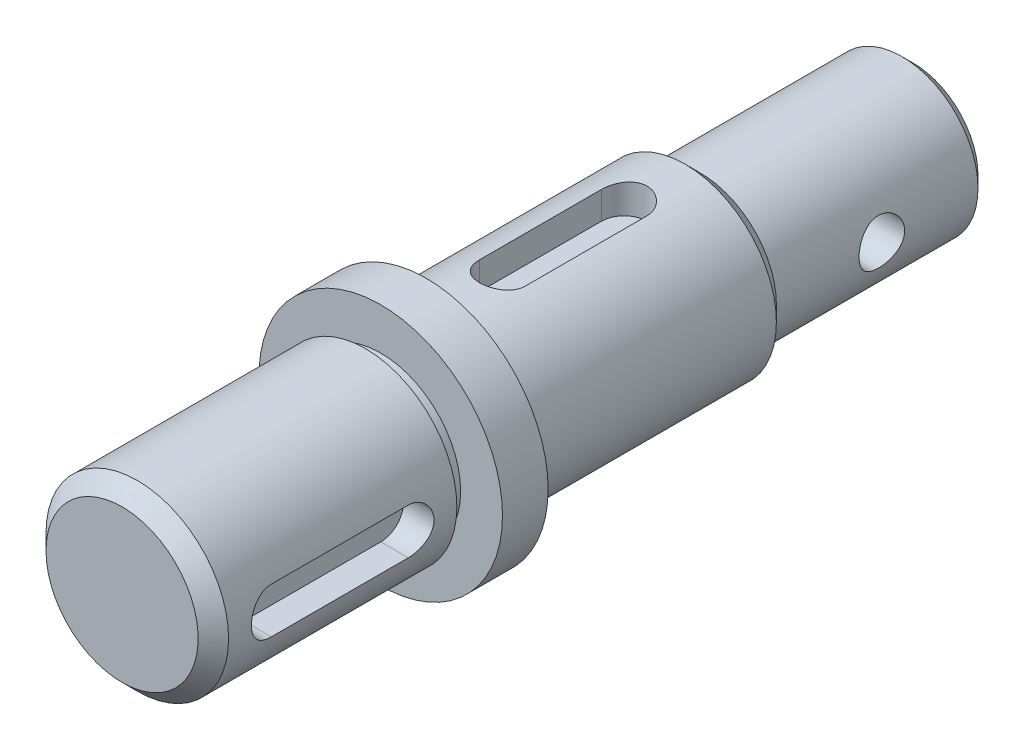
from build123d import *

# Parameters (mm, degrees)
CHAMFER_1_SIZE      = 1.5
CHAMFER_2_SIZE      = 2
SKETCH_3_R          = 3
CUT_EXTRUDE_1_DEPTH = 15
CUT_EXTRUDE_2_DEPTH = 4
CUT_EXTRUDE_3_DEPTH = 4


with BuildPart() as part:
    # Sketch 2 → Revolve 2 (revolve)
    with BuildSketch(Plane(origin=(0, 0, 0), x_dir=(0, 0, -1), z_dir=(1, 0, 0)), mode=Mode.PRIVATE) as revolve_2_sk:
        Polygon((-112.994341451, 0), (-112.994341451, 12), (-80.994341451, 12), (-80.994341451, 10.5), (-78.994341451, 10.5), (-78.994341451, 16), (-72.994341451, 16), (-72.994341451, 10.5), (-70.994341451, 10.5), (-70.994341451, 12), (-38.994341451, 12), (-36.994341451, 10), (-8.994341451, 10), (-8.994341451, 0), align=None)
    revolve(revolve_2_sk.sketch.rotate(Axis((0, 0, 103.768466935), (0, 0, -1)), 90), axis=Axis((0, 0, 103.768466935), (0, 0, -1)))

    # Chamfer 1
    chamfer_1_edges = [part.edges().sort_by_distance(p)[0] for p in [
        (-10, 0, 8.994341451),
    ]]
    chamfer(chamfer_1_edges, length=CHAMFER_1_SIZE)

    # Chamfer 2
    chamfer_2_edges = [part.edges().sort_by_distance(p)[0] for p in [
        (-12, 0, 112.994341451),
    ]]
    chamfer(chamfer_2_edges, length=CHAMFER_2_SIZE)

    # Sketch 3 → Cut-Extrude 1 (cut, symmetric)
    with BuildSketch(Plane(origin=(0, 0, 0), x_dir=(0, 0, -1), z_dir=(1, 0, 0))):
        with Locations((-23.126359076, 0)):
            Circle(SKETCH_3_R)
    extrude(amount=CUT_EXTRUDE_1_DEPTH, both=True, mode=Mode.SUBTRACT)

    # Sketch 4 → Cut-Extrude 2 (cut)
    with BuildSketch(Plane(origin=(12, 0, 0), x_dir=(0, 0, -1), z_dir=(1, 0, 0))):
        with BuildLine():
            Line((-104.994341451, 3), (-86.994341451, 3))
            ThreePointArc((-86.994341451, 3), (-83.994341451, 0), (-86.994341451, -3))
            Line((-86.994341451, -3), (-104.994341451, -3))
            ThreePointArc((-104.994341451, -3), (-107.994341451, 0), (-104.994341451, 3))
        make_face()
    extrude(amount=-CUT_EXTRUDE_2_DEPTH, mode=Mode.SUBTRACT)

    # Sketch 5 → Cut-Extrude 3 (cut)
    with BuildSketch(Plane(origin=(0, 12, 0), x_dir=(-1, 0, 0), z_dir=(0, 1, 0))):
        with BuildLine():
            Line((3, 46.994341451), (3, 62.994341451))
            ThreePointArc((3, 62.994341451), (0, 65.994341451), (-3, 62.994341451))
            Line((-3, 62.994341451), (-3, 46.994341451))
            ThreePointArc((-3, 46.994341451), (0, 43.994341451), (3, 46.994341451))
        make_face()
    extrude(amount=-CUT_EXTRUDE_3_DEPTH, mode=Mode.SUBTRACT)


solid = part.part
